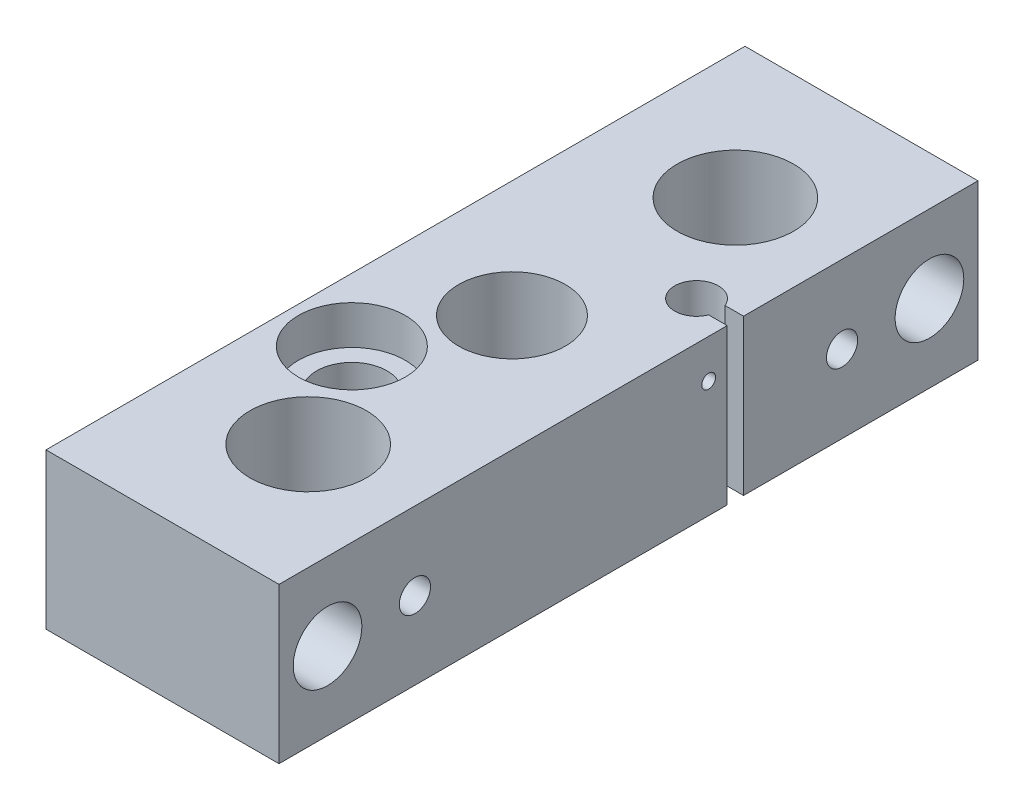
from build123d import *

# Parameters (mm, degrees)
SKETCH1_W                                      = 38.1
SKETCH1_H                                      = 114.3
EXTRUDE1_DEPTH                                 = 12.7
SKETCH2_R                                      = 9.525
CUT_EXTRUDE1_DEPTH                             = 66.377251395
F_1_4_20_MOUNTING_HOLES_REACH                  = 71.85
F_1_4_20_MOUNTING_HOLES_BORE_R                 = 2.5527
CBORE_FOR_5_16_SHCS_MOUNTING_HOLES_D           = 8.4328
CBORE_FOR_5_16_SHCS_MOUNTING_HOLES_CBORE_D     = 11.2268
CBORE_FOR_5_16_SHCS_MOUNTING_HOLES_CBORE_DEPTH = 7.9375
SKETCH7_R                                      = 8.7376
CUT_EXTRUDE2_DEPTH                             = 6.35
F_1_2_20_SHOCK_MOUNT_D                         = 11.50874
SKETCH10_R                                     = 8.73125
CUT_EXTRUDE3_DEPTH                             = 12.7
F_4_40_TAPPED_HOLE1_D                          = 2.2606
F_4_40_TAPPED_HOLE1_DEPTH                      = 12.827
F_4_40_TAPPED_HOLE1_TIP                        = 0.679152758
CUT_EXTRUDE4_SENSOR_MOUNT_DEPTH                = 66.377251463


with BuildPart() as part:
    # Sketch1 → Extrude1 (new, symmetric)
    with BuildSketch(Plane(origin=(0, 0, 0), x_dir=(1, 0, 0), z_dir=(0, 1, 0))):
        Rectangle(SKETCH1_W, SKETCH1_H)
    extrude(amount=EXTRUDE1_DEPTH, both=True)

    # Sketch2 → Cut-Extrude1 (cut, through all)
    with BuildSketch(Plane(origin=(0, 12.7, 0), x_dir=(-1, 0, 0), z_dir=(0, 1, 0))):
        with Locations(Location((-1.6002, 34.925, 0), (0, 0, 90))):
            Circle(SKETCH2_R)
        with Locations(Location((-1.6002, -34.925, 0), (0, 0, 270))):
            Circle(SKETCH2_R)
    extrude(amount=-CUT_EXTRUDE1_DEPTH, mode=Mode.SUBTRACT)

    # 1_4-20 _Mounting Holes bore → 1_4-20 _Mounting Holes (cut, up to next)
    with BuildSketch(Plane(origin=(19.05, 0, 0), x_dir=(0, 0, -1), z_dir=(1, 0, 0)), mode=Mode.PRIVATE) as f_1_4_20_mounting_holes_sk1:
        with Locations((-34.925, 0)):
            Circle(F_1_4_20_MOUNTING_HOLES_BORE_R)
    f_1_4_20_mounting_holes_tool1 = extrude(f_1_4_20_mounting_holes_sk1.sketch, amount=-F_1_4_20_MOUNTING_HOLES_REACH, mode=Mode.PRIVATE) & part.part
    # 1_4-20 _Mounting Holes bore → 1_4-20 _Mounting Holes (cut, up to next)
    with BuildSketch(Plane(origin=(19.05, 0, 0), x_dir=(0, 0, -1), z_dir=(1, 0, 0)), mode=Mode.PRIVATE) as f_1_4_20_mounting_holes_sk2:
        with Locations((34.925, 0)):
            Circle(F_1_4_20_MOUNTING_HOLES_BORE_R)
    f_1_4_20_mounting_holes_tool2 = extrude(f_1_4_20_mounting_holes_sk2.sketch, amount=-F_1_4_20_MOUNTING_HOLES_REACH, mode=Mode.PRIVATE) & part.part
    add(f_1_4_20_mounting_holes_tool1.solids().sort_by_distance((19.05, 0, 34.925))[0], mode=Mode.SUBTRACT)
    add(f_1_4_20_mounting_holes_tool2.solids().sort_by_distance((19.05, 0, -34.925))[0], mode=Mode.SUBTRACT)

    # CBORE for 5_16 Shcs _Mounting Holes (through all)
    with Locations(Plane(origin=(19.05, 0, 0), x_dir=(0, 0, -1), z_dir=(1, 0, 0))):
        with Locations((49.2125, 0), (-49.2125, 0)):
            CounterBoreHole(CBORE_FOR_5_16_SHCS_MOUNTING_HOLES_D / 2, CBORE_FOR_5_16_SHCS_MOUNTING_HOLES_CBORE_D / 2, CBORE_FOR_5_16_SHCS_MOUNTING_HOLES_CBORE_DEPTH)

    # Sketch7 → Cut-Extrude2 (cut)
    with BuildSketch(Plane(origin=(0, 12.7, 0), x_dir=(-1, 0, 0), z_dir=(0, 1, 0))):
        with Locations(Location((8.7122, 17.4752, 0), (0, 0, 90))):
            Circle(SKETCH7_R)
    extrude(amount=-CUT_EXTRUDE2_DEPTH, mode=Mode.SUBTRACT)

    # 1_2-20 _Shock Mount (through all)
    with Locations(Plane(origin=(0, 6.35, 0), x_dir=(-1, 0, 0), z_dir=(0, 1, 0))):
        with Locations((8.7122, 17.4752)):
            Hole(F_1_2_20_SHOCK_MOUNT_D / 2)

    # Sketch10 → Cut-Extrude3 (cut)
    with BuildSketch(Plane(origin=(0, 12.7, 0), x_dir=(-1, 0, 0), z_dir=(0, 1, 0))):
        with Locations(Location((0, 0, 0), (0, 0, 90))):
            Circle(SKETCH10_R)
    extrude(amount=-CUT_EXTRUDE3_DEPTH, mode=Mode.SUBTRACT)

    # Sketch13 → 1_8 NPT _Air Port (revolve, cut)
    with BuildSketch(Plane(origin=(0, -12.7, 0), x_dir=(0, 0, -1), z_dir=(1, 0, 0))):
        Polygon((0, 0), (0, 25.4), (4.2164, 25.4), (4.2164, 6.92404), (4.53740497, 6.92404), (4.74472, 0), align=None)
    revolve(axis=Axis((0, -19.05, 0), (0, 1, 0)), mode=Mode.SUBTRACT)

    # 4-40 Tapped Hole1
    with Locations(Plane(origin=(19.05, 0, 0), x_dir=(0, 0, -1), z_dir=(1, 0, 0))):
        with Locations((13.1064, 6.35)):
            Hole(F_4_40_TAPPED_HOLE1_D / 2, depth=F_4_40_TAPPED_HOLE1_DEPTH)
            with Locations((0, 0, -(F_4_40_TAPPED_HOLE1_DEPTH + F_4_40_TAPPED_HOLE1_TIP / 2))):  # 118° drill point
                Cone(0, F_4_40_TAPPED_HOLE1_D / 2, F_4_40_TAPPED_HOLE1_TIP, mode=Mode.SUBTRACT)

    # Sketch17 → Cut-Extrude4 _Sensor Mount (cut, through all)
    with BuildSketch(Plane(origin=(0, 12.7, 0), x_dir=(-1, 0, 0), z_dir=(0, 1, 0))):
        with BuildLine():
            Line((-19.05, -18.810926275), (-16.020204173, -18.810926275))
            ThreePointArc((-16.020204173, -18.810926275), (-9.121184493, -17.4752), (-16.020204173, -16.139473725))
            Line((-16.020204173, -16.139473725), (-19.05, -16.139473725))
            Line((-19.05, -16.139473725), (-19.05, -18.810926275))
        make_face()
    extrude(amount=-CUT_EXTRUDE4_SENSOR_MOUNT_DEPTH, mode=Mode.SUBTRACT)


solid = part.part
